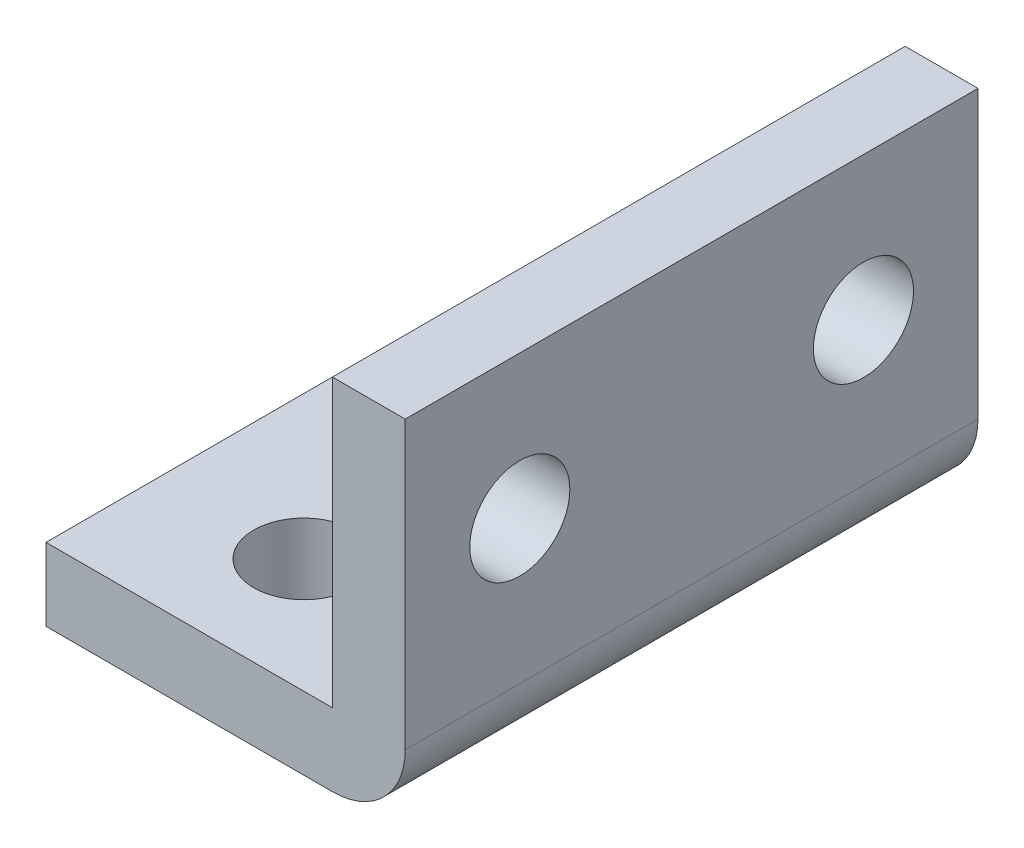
from build123d import *

# Parameters (mm, degrees)
SKETCH1_W           = 12.5
SKETCH1_H           = 25
SKETCH1_R           = 2.1844
BOSS_EXTRUDE1_DEPTH = 3.175
SKETCH4_W           = 3.18
SKETCH4_H           = 25
EXTRUDE_THIN1_DEPTH = 15.675
SKETCH6_R           = 2.1844
CUT_EXTRUDE1_DEPTH  = 24.626375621
FILLET1_R           = 3.175


with BuildPart() as part:
    # Sketch1 → Boss-Extrude1 (new body)
    with BuildSketch(Plane(origin=(0, 0, 0), x_dir=(1, 0, 0), z_dir=(0, 1, 0))):
        Rectangle(SKETCH1_W, SKETCH1_H)
        with Locations(Location((0, 7.5, 0), (0, 0, 270))):
            Circle(SKETCH1_R, mode=Mode.SUBTRACT)
        with Locations(Location((0, -7.5, 0), (0, 0, 90))):
            Circle(SKETCH1_R, mode=Mode.SUBTRACT)
    extrude(amount=BOSS_EXTRUDE1_DEPTH)

    # Sketch4 → Extrude-Thin1 (add)
    with BuildSketch(Plane.XZ):
        with Locations((7.84, 0)):
            Rectangle(SKETCH4_W, SKETCH4_H)
    extrude(amount=-EXTRUDE_THIN1_DEPTH)

    # Sketch6 → Cut-Extrude1 (cut, through all)
    with BuildSketch(Plane.ZY.offset(-6.25)):
        with Locations((-7.5, 9.425)):
            Circle(SKETCH6_R)
        with Locations(Location((7.5, 9.425, 0), (0, 0, 180))):
            Circle(SKETCH6_R)
    extrude(amount=-CUT_EXTRUDE1_DEPTH, mode=Mode.SUBTRACT)

    # Fillet1
    fillet1_edges = [part.edges().sort_by_distance(p)[0] for p in [
        (9.43, 0, 0),
    ]]
    fillet(fillet1_edges, radius=FILLET1_R)


solid = part.part
